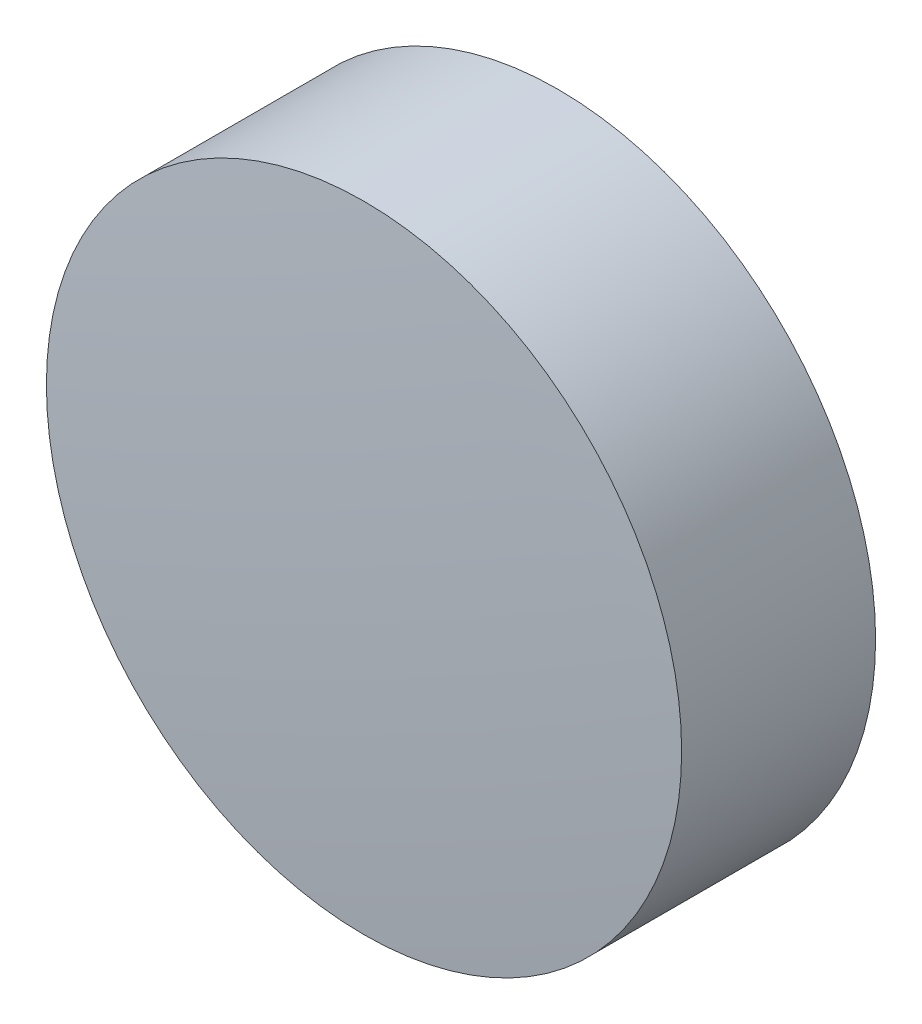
ISO-10303-21;
HEADER;
FILE_DESCRIPTION(('STEP AP214'),'2;1');
FILE_NAME('part.step','',(''),(''),'','','');
FILE_SCHEMA(('AUTOMOTIVE_DESIGN { 1 0 10303 214 1 1 1 1 }'));
ENDSEC;
DATA;
#1=APPLICATION_CONTEXT('core data for automotive mechanical design processes');
#2=APPLICATION_PROTOCOL_DEFINITION('international standard','automotive_design',2000,#1);
#3=PRODUCT_CONTEXT('',#1,'mechanical');
#4=PRODUCT('Part','Part','',(#3));
#5=PRODUCT_RELATED_PRODUCT_CATEGORY('part','',(#4));
#6=PRODUCT_DEFINITION_FORMATION('','',#4);
#7=PRODUCT_DEFINITION_CONTEXT('part definition',#1,'design');
#8=PRODUCT_DEFINITION('design','',#6,#7);
#9=PRODUCT_DEFINITION_SHAPE('','',#8);
#10=(LENGTH_UNIT() NAMED_UNIT(*) SI_UNIT(.MILLI.,.METRE.));
#11=(NAMED_UNIT(*) PLANE_ANGLE_UNIT() SI_UNIT($,.RADIAN.));
#12=(NAMED_UNIT(*) SI_UNIT($,.STERADIAN.) SOLID_ANGLE_UNIT());
#13=UNCERTAINTY_MEASURE_WITH_UNIT(LENGTH_MEASURE(1.E-05),#10,'distance_accuracy_value','');
#14=(GEOMETRIC_REPRESENTATION_CONTEXT(3) GLOBAL_UNCERTAINTY_ASSIGNED_CONTEXT((#13)) GLOBAL_UNIT_ASSIGNED_CONTEXT((#10,
#11,#12)) REPRESENTATION_CONTEXT('',''));
#15=CARTESIAN_POINT('',(0.,0.,0.));
#16=DIRECTION('',(0.,0.,1.));
#17=DIRECTION('',(1.,0.,0.));
#18=AXIS2_PLACEMENT_3D('',#15,#16,#17);
#19=CARTESIAN_POINT('',(0.,0.,-77.1300000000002));
#20=DIRECTION('',(0.,-1.,0.));
#21=DIRECTION('',(0.,0.,1.));
#22=AXIS2_PLACEMENT_3D('',#19,#20,#21);
#23=SPHERICAL_SURFACE('',#22,84.1300000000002);
#24=CARTESIAN_POINT('',(0.,0.,6.78577265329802));
#25=DIRECTION('',(0.,0.,1.));
#26=DIRECTION('',(1.,0.,0.));
#27=AXIS2_PLACEMENT_3D('',#24,#25,#26);
#28=CIRCLE('',#27,6.);
#29=CARTESIAN_POINT('',(6.,0.,6.78577265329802));
#30=VERTEX_POINT('',#29);
#31=EDGE_CURVE('E19',#30,#30,#28,.F.);
#32=ORIENTED_EDGE('',*,*,#31,.F.);
#33=EDGE_LOOP('',(#32));
#34=FACE_BOUND('',#33,.T.);
#35=ADVANCED_FACE('F15',(#34),#23,.T.);
#36=CARTESIAN_POINT('',(0.,0.,-9.25000000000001));
#37=DIRECTION('',(0.,1.,0.));
#38=DIRECTION('',(0.,0.,1.));
#39=AXIS2_PLACEMENT_3D('',#36,#37,#38);
#40=SPHERICAL_SURFACE('',#39,13.75);
#41=CARTESIAN_POINT('',(0.,0.,3.12184303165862));
#42=DIRECTION('',(0.,0.,1.));
#43=DIRECTION('',(1.,0.,0.));
#44=AXIS2_PLACEMENT_3D('',#41,#42,#43);
#45=CIRCLE('',#44,6.);
#46=CARTESIAN_POINT('',(6.,0.,3.12184303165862));
#47=VERTEX_POINT('',#46);
#48=EDGE_CURVE('E10',#47,#47,#45,.T.);
#49=ORIENTED_EDGE('',*,*,#48,.F.);
#50=EDGE_LOOP('',(#49));
#51=FACE_BOUND('',#50,.T.);
#52=ADVANCED_FACE('F29',(#51),#40,.F.);
#53=CARTESIAN_POINT('',(0.,0.,3.12184303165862));
#54=DIRECTION('',(0.,0.,1.));
#55=DIRECTION('',(1.,0.,0.));
#56=AXIS2_PLACEMENT_3D('',#53,#54,#55);
#57=CYLINDRICAL_SURFACE('',#56,6.);
#58=ORIENTED_EDGE('',*,*,#48,.T.);
#59=EDGE_LOOP('',(#58));
#60=FACE_BOUND('',#59,.T.);
#61=ORIENTED_EDGE('',*,*,#31,.T.);
#62=EDGE_LOOP('',(#61));
#63=FACE_BOUND('',#62,.T.);
#64=ADVANCED_FACE('F32',(#60,#63),#57,.T.);
#65=CLOSED_SHELL('',(#35,#52,#64));
#66=MANIFOLD_SOLID_BREP('B1',#65);
#67=ADVANCED_BREP_SHAPE_REPRESENTATION('',(#18,#66),#14);
#68=SHAPE_DEFINITION_REPRESENTATION(#9,#67);
ENDSEC;
END-ISO-10303-21;
